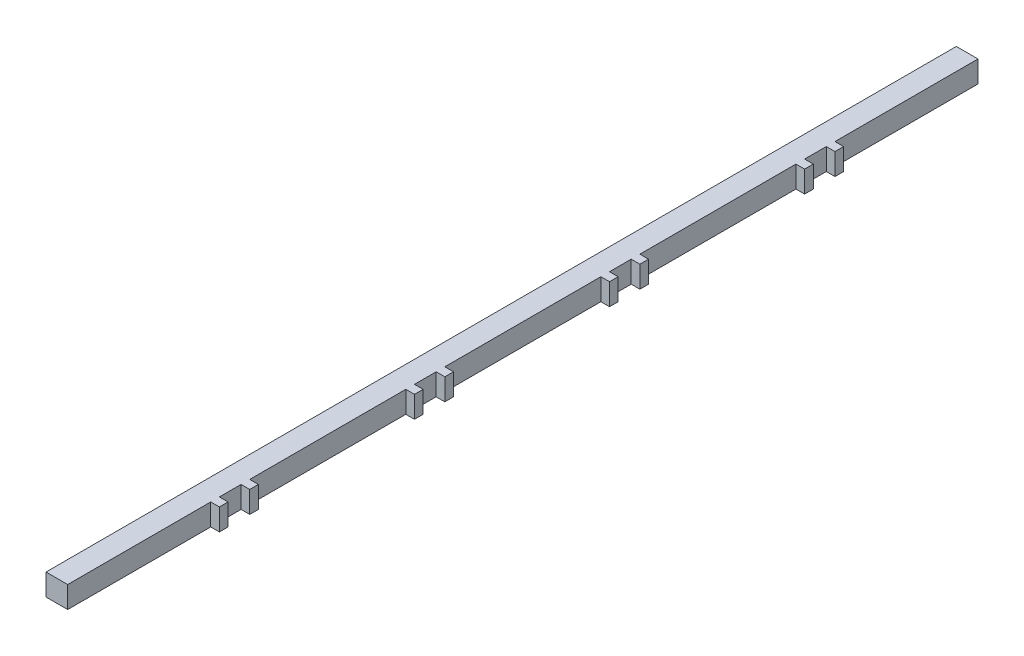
from build123d import *

# Parameters (mm, degrees)
SKETCH1_W           = 6.35
SKETCH1_H           = 6.35
BOSS_EXTRUDE1_DEPTH = 279.4
SKETCH2_W           = 2.54
SKETCH2_H           = 6.35
BOSS_EXTRUDE2_DEPTH = 2.54
SKETCH3_W           = 6.35
SKETCH3_H           = 6.35
CUT_EXTRUDE1_DEPTH  = 280.544280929


with BuildPart() as part:
    # Sketch1 → Boss-Extrude1 (new body)
    with BuildSketch(Plane.XY):
        with Locations((-3.175, 3.175)):
            Rectangle(SKETCH1_W, SKETCH1_H)
    extrude(amount=BOSS_EXTRUDE1_DEPTH)

    # Sketch2 → Boss-Extrude2 (add)
    with BuildSketch(Plane(origin=(0, 0, 0), x_dir=(0, 0, -1), z_dir=(1, 0, 0))):
        with Locations((-229.87, 3.175)):
            Rectangle(SKETCH2_W, SKETCH2_H)
        with Locations((-172.72, 3.175)):
            Rectangle(SKETCH2_W, SKETCH2_H)
        with Locations((-220.98, 3.175)):
            Rectangle(SKETCH2_W, SKETCH2_H)
        with Locations((-163.83, 3.175)):
            Rectangle(SKETCH2_W, SKETCH2_H)
        with Locations((-115.57, 3.175)):
            Rectangle(SKETCH2_W, SKETCH2_H)
        with Locations((-106.68, 3.175)):
            Rectangle(SKETCH2_W, SKETCH2_H)
        with Locations((-58.42, 3.175)):
            Rectangle(SKETCH2_W, SKETCH2_H)
        with Locations((-49.53, 3.175)):
            Rectangle(SKETCH2_W, SKETCH2_H)
    extrude(amount=BOSS_EXTRUDE2_DEPTH)

    # Sketch3 → Cut-Extrude1 (cut, through all)
    with BuildSketch(Plane(origin=(0, 6.35, 0), x_dir=(1, 0, 0), z_dir=(0, 1, 0))):
        with Locations((-3.175, -276.225)):
            Rectangle(SKETCH3_W, SKETCH3_H)
        with Locations((-3.175, -3.175)):
            Rectangle(SKETCH3_W, SKETCH3_H)
    extrude(amount=-CUT_EXTRUDE1_DEPTH, mode=Mode.SUBTRACT)


solid = part.part
